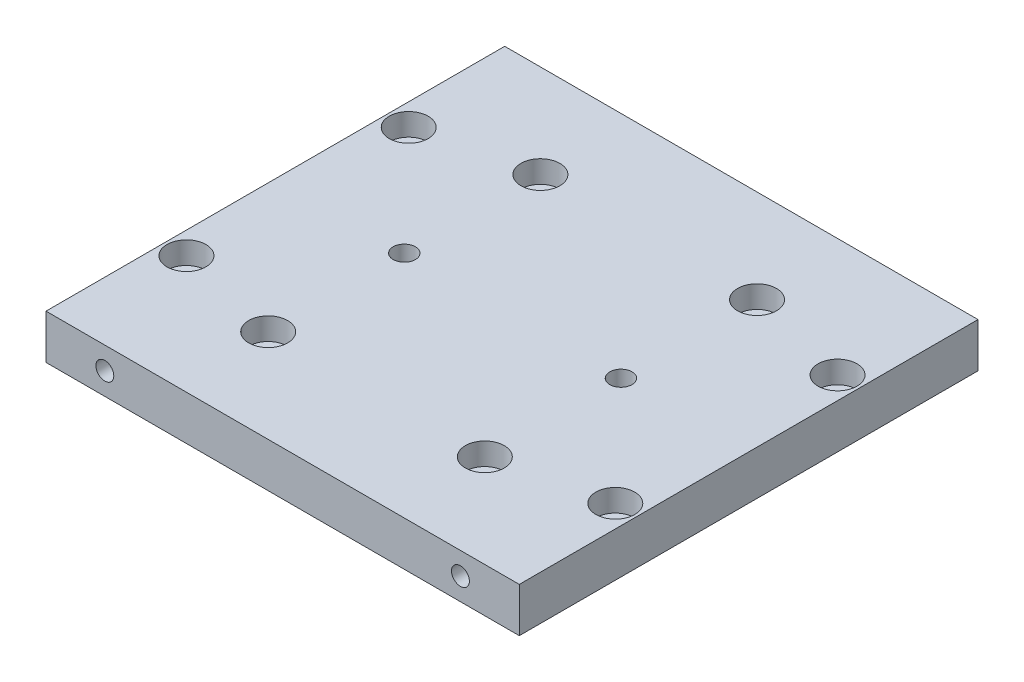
ISO-10303-21;
HEADER;
FILE_DESCRIPTION(('STEP AP214'),'2;1');
FILE_NAME('part.step','',(''),(''),'','','');
FILE_SCHEMA(('AUTOMOTIVE_DESIGN { 1 0 10303 214 1 1 1 1 }'));
ENDSEC;
DATA;
#1=APPLICATION_CONTEXT('core data for automotive mechanical design processes');
#2=APPLICATION_PROTOCOL_DEFINITION('international standard','automotive_design',2000,#1);
#3=PRODUCT_CONTEXT('',#1,'mechanical');
#4=PRODUCT('Part','Part','',(#3));
#5=PRODUCT_RELATED_PRODUCT_CATEGORY('part','',(#4));
#6=PRODUCT_DEFINITION_FORMATION('','',#4);
#7=PRODUCT_DEFINITION_CONTEXT('part definition',#1,'design');
#8=PRODUCT_DEFINITION('design','',#6,#7);
#9=PRODUCT_DEFINITION_SHAPE('','',#8);
#10=(LENGTH_UNIT() NAMED_UNIT(*) SI_UNIT(.MILLI.,.METRE.));
#11=(NAMED_UNIT(*) PLANE_ANGLE_UNIT() SI_UNIT($,.RADIAN.));
#12=(NAMED_UNIT(*) SI_UNIT($,.STERADIAN.) SOLID_ANGLE_UNIT());
#13=UNCERTAINTY_MEASURE_WITH_UNIT(LENGTH_MEASURE(1.E-05),#10,'distance_accuracy_value','');
#14=(GEOMETRIC_REPRESENTATION_CONTEXT(3) GLOBAL_UNCERTAINTY_ASSIGNED_CONTEXT((#13)) GLOBAL_UNIT_ASSIGNED_CONTEXT((#10,
#11,#12)) REPRESENTATION_CONTEXT('',''));
#15=CARTESIAN_POINT('',(0.,0.,0.));
#16=DIRECTION('',(0.,0.,1.));
#17=DIRECTION('',(1.,0.,0.));
#18=AXIS2_PLACEMENT_3D('',#15,#16,#17);
#19=CARTESIAN_POINT('',(67.6148,12.7,-65.532));
#20=DIRECTION('',(-1.,0.,0.));
#21=DIRECTION('',(0.,0.,1.));
#22=AXIS2_PLACEMENT_3D('',#19,#20,#21);
#23=PLANE('',#22);
#24=DIRECTION('',(0.,0.,-1.));
#25=VECTOR('',#24,1.);
#26=CARTESIAN_POINT('',(67.6148,0.,-65.532));
#27=LINE('',#26,#25);
#28=CARTESIAN_POINT('',(67.6148,0.,65.532));
#29=VERTEX_POINT('',#28);
#30=CARTESIAN_POINT('',(67.6148,0.,-65.532));
#31=VERTEX_POINT('',#30);
#32=EDGE_CURVE('E222',#29,#31,#27,.T.);
#33=ORIENTED_EDGE('',*,*,#32,.T.);
#34=DIRECTION('',(0.,-1.,0.));
#35=VECTOR('',#34,1.);
#36=CARTESIAN_POINT('',(67.6148,12.7,-65.532));
#37=LINE('',#36,#35);
#38=CARTESIAN_POINT('',(67.6148,12.7,-65.532));
#39=VERTEX_POINT('',#38);
#40=EDGE_CURVE('E11',#39,#31,#37,.T.);
#41=ORIENTED_EDGE('',*,*,#40,.F.);
#42=DIRECTION('',(0.,0.,-1.));
#43=VECTOR('',#42,1.);
#44=CARTESIAN_POINT('',(67.6148,12.7,-65.532));
#45=LINE('',#44,#43);
#46=CARTESIAN_POINT('',(67.6148,12.7,65.532));
#47=VERTEX_POINT('',#46);
#48=EDGE_CURVE('E223',#47,#39,#45,.T.);
#49=ORIENTED_EDGE('',*,*,#48,.F.);
#50=DIRECTION('',(0.,-1.,0.));
#51=VECTOR('',#50,1.);
#52=CARTESIAN_POINT('',(67.6148,12.7,65.532));
#53=LINE('',#52,#51);
#54=EDGE_CURVE('E229',#47,#29,#53,.T.);
#55=ORIENTED_EDGE('',*,*,#54,.T.);
#56=EDGE_LOOP('',(#33,#41,#49,#55));
#57=FACE_BOUND('',#56,.T.);
#58=ADVANCED_FACE('F39',(#57),#23,.F.);
#59=CARTESIAN_POINT('',(-67.6148,12.7,-65.532));
#60=DIRECTION('',(0.,0.,1.));
#61=DIRECTION('',(1.,0.,0.));
#62=AXIS2_PLACEMENT_3D('',#59,#60,#61);
#63=PLANE('',#62);
#64=DIRECTION('',(-1.,0.,0.));
#65=VECTOR('',#64,1.);
#66=CARTESIAN_POINT('',(-67.6148,0.,-65.532));
#67=LINE('',#66,#65);
#68=CARTESIAN_POINT('',(-67.6148,0.,-65.532));
#69=VERTEX_POINT('',#68);
#70=EDGE_CURVE('E232',#31,#69,#67,.T.);
#71=ORIENTED_EDGE('',*,*,#70,.T.);
#72=DIRECTION('',(0.,-1.,0.));
#73=VECTOR('',#72,1.);
#74=CARTESIAN_POINT('',(-67.6148,12.7,-65.532));
#75=LINE('',#74,#73);
#76=CARTESIAN_POINT('',(-67.6148,12.7,-65.532));
#77=VERTEX_POINT('',#76);
#78=EDGE_CURVE('E47',#77,#69,#75,.T.);
#79=ORIENTED_EDGE('',*,*,#78,.F.);
#80=DIRECTION('',(-1.,0.,0.));
#81=VECTOR('',#80,1.);
#82=CARTESIAN_POINT('',(-67.6148,12.7,-65.532));
#83=LINE('',#82,#81);
#84=EDGE_CURVE('E86',#39,#77,#83,.T.);
#85=ORIENTED_EDGE('',*,*,#84,.F.);
#86=ORIENTED_EDGE('',*,*,#40,.T.);
#87=EDGE_LOOP('',(#71,#79,#85,#86));
#88=FACE_BOUND('',#87,.T.);
#89=ADVANCED_FACE('F257',(#88),#63,.F.);
#90=CARTESIAN_POINT('',(-67.6148,12.7,-65.532));
#91=DIRECTION('',(1.,0.,0.));
#92=DIRECTION('',(0.,0.,-1.));
#93=AXIS2_PLACEMENT_3D('',#90,#91,#92);
#94=PLANE('',#93);
#95=DIRECTION('',(0.,0.,1.));
#96=VECTOR('',#95,1.);
#97=CARTESIAN_POINT('',(-67.6148,0.,-65.532));
#98=LINE('',#97,#96);
#99=CARTESIAN_POINT('',(-67.6148,0.,65.532));
#100=VERTEX_POINT('',#99);
#101=EDGE_CURVE('E73',#69,#100,#98,.T.);
#102=ORIENTED_EDGE('',*,*,#101,.T.);
#103=DIRECTION('',(0.,-1.,0.));
#104=VECTOR('',#103,1.);
#105=CARTESIAN_POINT('',(-67.6148,12.7,65.532));
#106=LINE('',#105,#104);
#107=CARTESIAN_POINT('',(-67.6148,12.7,65.532));
#108=VERTEX_POINT('',#107);
#109=EDGE_CURVE('E237',#108,#100,#106,.T.);
#110=ORIENTED_EDGE('',*,*,#109,.F.);
#111=DIRECTION('',(0.,0.,1.));
#112=VECTOR('',#111,1.);
#113=CARTESIAN_POINT('',(-67.6148,12.7,-65.532));
#114=LINE('',#113,#112);
#115=EDGE_CURVE('E226',#77,#108,#114,.T.);
#116=ORIENTED_EDGE('',*,*,#115,.F.);
#117=ORIENTED_EDGE('',*,*,#78,.T.);
#118=EDGE_LOOP('',(#102,#110,#116,#117));
#119=FACE_BOUND('',#118,.T.);
#120=ADVANCED_FACE('F239',(#119),#94,.F.);
#121=CARTESIAN_POINT('',(-67.6148,12.7,65.532));
#122=DIRECTION('',(0.,0.,-1.));
#123=DIRECTION('',(-1.,0.,0.));
#124=AXIS2_PLACEMENT_3D('',#121,#122,#123);
#125=PLANE('',#124);
#126=CARTESIAN_POINT('',(-50.8,6.35,65.532));
#127=DIRECTION('',(0.,0.,1.));
#128=DIRECTION('',(1.,0.,0.));
#129=AXIS2_PLACEMENT_3D('',#126,#127,#128);
#130=CIRCLE('',#129,2.55269999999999);
#131=CARTESIAN_POINT('',(-48.2473,6.35,65.532));
#132=VERTEX_POINT('',#131);
#133=EDGE_CURVE('E104',#132,#132,#130,.T.);
#134=ORIENTED_EDGE('',*,*,#133,.F.);
#135=EDGE_LOOP('',(#134));
#136=FACE_BOUND('',#135,.T.);
#137=CARTESIAN_POINT('',(50.8,6.35000000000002,65.532));
#138=DIRECTION('',(0.,0.,1.));
#139=DIRECTION('',(1.,0.,0.));
#140=AXIS2_PLACEMENT_3D('',#137,#138,#139);
#141=CIRCLE('',#140,2.55269999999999);
#142=CARTESIAN_POINT('',(53.3527,6.35000000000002,65.532));
#143=VERTEX_POINT('',#142);
#144=EDGE_CURVE('E103',#143,#143,#141,.T.);
#145=ORIENTED_EDGE('',*,*,#144,.F.);
#146=EDGE_LOOP('',(#145));
#147=FACE_BOUND('',#146,.T.);
#148=DIRECTION('',(1.,0.,0.));
#149=VECTOR('',#148,1.);
#150=CARTESIAN_POINT('',(-67.6148,0.,65.532));
#151=LINE('',#150,#149);
#152=EDGE_CURVE('E79',#100,#29,#151,.T.);
#153=ORIENTED_EDGE('',*,*,#152,.T.);
#154=ORIENTED_EDGE('',*,*,#54,.F.);
#155=DIRECTION('',(1.,0.,0.));
#156=VECTOR('',#155,1.);
#157=CARTESIAN_POINT('',(-67.6148,12.7,65.532));
#158=LINE('',#157,#156);
#159=EDGE_CURVE('E55',#108,#47,#158,.T.);
#160=ORIENTED_EDGE('',*,*,#159,.F.);
#161=ORIENTED_EDGE('',*,*,#109,.T.);
#162=EDGE_LOOP('',(#153,#154,#160,#161));
#163=FACE_BOUND('',#162,.T.);
#164=ADVANCED_FACE('F246',(#136,#147,#163),#125,.F.);
#165=CARTESIAN_POINT('',(0.,12.7,0.));
#166=DIRECTION('',(0.,1.,0.));
#167=DIRECTION('',(0.,0.,1.));
#168=AXIS2_PLACEMENT_3D('',#165,#166,#167);
#169=PLANE('',#168);
#170=CARTESIAN_POINT('',(-61.2648,12.7,31.75));
#171=DIRECTION('',(0.,1.,0.));
#172=DIRECTION('',(0.,0.,1.));
#173=AXIS2_PLACEMENT_3D('',#170,#171,#172);
#174=CIRCLE('',#173,5.55625);
#175=CARTESIAN_POINT('',(-61.2648,12.7,37.30625));
#176=VERTEX_POINT('',#175);
#177=EDGE_CURVE('E114',#176,#176,#174,.T.);
#178=ORIENTED_EDGE('',*,*,#177,.F.);
#179=EDGE_LOOP('',(#178));
#180=FACE_BOUND('',#179,.T.);
#181=CARTESIAN_POINT('',(-61.2648,12.7,-31.75));
#182=DIRECTION('',(0.,1.,0.));
#183=DIRECTION('',(0.,0.,1.));
#184=AXIS2_PLACEMENT_3D('',#181,#182,#183);
#185=CIRCLE('',#184,5.55624999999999);
#186=CARTESIAN_POINT('',(-61.2648,12.7,-26.1937500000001));
#187=VERTEX_POINT('',#186);
#188=EDGE_CURVE('E126',#187,#187,#185,.T.);
#189=ORIENTED_EDGE('',*,*,#188,.F.);
#190=EDGE_LOOP('',(#189));
#191=FACE_BOUND('',#190,.T.);
#192=CARTESIAN_POINT('',(61.2648,12.7,31.7500000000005));
#193=DIRECTION('',(0.,1.,0.));
#194=DIRECTION('',(0.,0.,1.));
#195=AXIS2_PLACEMENT_3D('',#192,#193,#194);
#196=CIRCLE('',#195,5.55624999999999);
#197=CARTESIAN_POINT('',(61.2648,12.7,37.3062500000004));
#198=VERTEX_POINT('',#197);
#199=EDGE_CURVE('E138',#198,#198,#196,.T.);
#200=ORIENTED_EDGE('',*,*,#199,.F.);
#201=EDGE_LOOP('',(#200));
#202=FACE_BOUND('',#201,.T.);
#203=CARTESIAN_POINT('',(61.2648000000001,12.7,-31.7499999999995));
#204=DIRECTION('',(0.,1.,0.));
#205=DIRECTION('',(0.,0.,1.));
#206=AXIS2_PLACEMENT_3D('',#203,#204,#205);
#207=CIRCLE('',#206,5.55625);
#208=CARTESIAN_POINT('',(61.2648000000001,12.7,-26.1937499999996));
#209=VERTEX_POINT('',#208);
#210=EDGE_CURVE('E150',#209,#209,#207,.T.);
#211=ORIENTED_EDGE('',*,*,#210,.F.);
#212=EDGE_LOOP('',(#211));
#213=FACE_BOUND('',#212,.T.);
#214=CARTESIAN_POINT('',(-30.7768574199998,12.7,4.95300012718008E-06));
#215=DIRECTION('',(0.,1.,0.));
#216=DIRECTION('',(0.,0.,1.));
#217=AXIS2_PLACEMENT_3D('',#214,#215,#216);
#218=CIRCLE('',#217,3.175);
#219=CARTESIAN_POINT('',(-30.7768574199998,12.7,3.17500495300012));
#220=VERTEX_POINT('',#219);
#221=EDGE_CURVE('E162',#220,#220,#218,.T.);
#222=ORIENTED_EDGE('',*,*,#221,.F.);
#223=EDGE_LOOP('',(#222));
#224=FACE_BOUND('',#223,.T.);
#225=CARTESIAN_POINT('',(31.1229425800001,12.7,4.9530001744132E-06));
#226=DIRECTION('',(0.,1.,0.));
#227=DIRECTION('',(0.,0.,1.));
#228=AXIS2_PLACEMENT_3D('',#225,#226,#227);
#229=CIRCLE('',#228,3.175);
#230=CARTESIAN_POINT('',(31.1229425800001,12.7,3.17500495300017));
#231=VERTEX_POINT('',#230);
#232=EDGE_CURVE('E168',#231,#231,#229,.T.);
#233=ORIENTED_EDGE('',*,*,#232,.F.);
#234=EDGE_LOOP('',(#233));
#235=FACE_BOUND('',#234,.T.);
#236=CARTESIAN_POINT('',(31.1229425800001,12.7,38.8874049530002));
#237=DIRECTION('',(0.,1.,0.));
#238=DIRECTION('',(0.,0.,1.));
#239=AXIS2_PLACEMENT_3D('',#236,#237,#238);
#240=CIRCLE('',#239,5.55625);
#241=CARTESIAN_POINT('',(31.1229425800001,12.7,44.4436549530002));
#242=VERTEX_POINT('',#241);
#243=EDGE_CURVE('E174',#242,#242,#240,.T.);
#244=ORIENTED_EDGE('',*,*,#243,.F.);
#245=EDGE_LOOP('',(#244));
#246=FACE_BOUND('',#245,.T.);
#247=CARTESIAN_POINT('',(-30.7768574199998,12.7,38.8874049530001));
#248=DIRECTION('',(0.,1.,0.));
#249=DIRECTION('',(0.,0.,1.));
#250=AXIS2_PLACEMENT_3D('',#247,#248,#249);
#251=CIRCLE('',#250,5.55625);
#252=CARTESIAN_POINT('',(-30.7768574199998,12.7,44.4436549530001));
#253=VERTEX_POINT('',#252);
#254=EDGE_CURVE('E186',#253,#253,#251,.T.);
#255=ORIENTED_EDGE('',*,*,#254,.F.);
#256=EDGE_LOOP('',(#255));
#257=FACE_BOUND('',#256,.T.);
#258=CARTESIAN_POINT('',(-30.7768574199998,12.7,-38.8873950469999));
#259=DIRECTION('',(0.,1.,0.));
#260=DIRECTION('',(0.,0.,1.));
#261=AXIS2_PLACEMENT_3D('',#258,#259,#260);
#262=CIRCLE('',#261,5.55625);
#263=CARTESIAN_POINT('',(-30.7768574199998,12.7,-33.3311450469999));
#264=VERTEX_POINT('',#263);
#265=EDGE_CURVE('E198',#264,#264,#262,.T.);
#266=ORIENTED_EDGE('',*,*,#265,.F.);
#267=EDGE_LOOP('',(#266));
#268=FACE_BOUND('',#267,.T.);
#269=CARTESIAN_POINT('',(31.1229425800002,12.7,-38.8873950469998));
#270=DIRECTION('',(0.,1.,0.));
#271=DIRECTION('',(0.,0.,1.));
#272=AXIS2_PLACEMENT_3D('',#269,#270,#271);
#273=CIRCLE('',#272,5.55625);
#274=CARTESIAN_POINT('',(31.1229425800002,12.7,-33.3311450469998));
#275=VERTEX_POINT('',#274);
#276=EDGE_CURVE('E210',#275,#275,#273,.T.);
#277=ORIENTED_EDGE('',*,*,#276,.F.);
#278=EDGE_LOOP('',(#277));
#279=FACE_BOUND('',#278,.T.);
#280=ORIENTED_EDGE('',*,*,#48,.T.);
#281=ORIENTED_EDGE('',*,*,#84,.T.);
#282=ORIENTED_EDGE('',*,*,#115,.T.);
#283=ORIENTED_EDGE('',*,*,#159,.T.);
#284=EDGE_LOOP('',(#280,#281,#282,#283));
#285=FACE_BOUND('',#284,.T.);
#286=ADVANCED_FACE('F248',(#180,#191,#202,#213,#224,#235,#246,#257,#268,#279,#285),#169,.T.);
#287=CARTESIAN_POINT('',(0.,0.,0.));
#288=DIRECTION('',(0.,1.,0.));
#289=DIRECTION('',(0.,0.,1.));
#290=AXIS2_PLACEMENT_3D('',#287,#288,#289);
#291=PLANE('',#290);
#292=CARTESIAN_POINT('',(-61.2648,0.,31.75));
#293=DIRECTION('',(0.,1.,0.));
#294=DIRECTION('',(0.,0.,1.));
#295=AXIS2_PLACEMENT_3D('',#292,#293,#294);
#296=CIRCLE('',#295,3.3782);
#297=CARTESIAN_POINT('',(-61.2648,0.,35.1282));
#298=VERTEX_POINT('',#297);
#299=EDGE_CURVE('E123',#298,#298,#296,.T.);
#300=ORIENTED_EDGE('',*,*,#299,.T.);
#301=EDGE_LOOP('',(#300));
#302=FACE_BOUND('',#301,.T.);
#303=CARTESIAN_POINT('',(-61.2648,0.,-31.75));
#304=DIRECTION('',(0.,1.,0.));
#305=DIRECTION('',(0.,0.,1.));
#306=AXIS2_PLACEMENT_3D('',#303,#304,#305);
#307=CIRCLE('',#306,3.3782);
#308=CARTESIAN_POINT('',(-61.2648,0.,-28.3718));
#309=VERTEX_POINT('',#308);
#310=EDGE_CURVE('E135',#309,#309,#307,.T.);
#311=ORIENTED_EDGE('',*,*,#310,.T.);
#312=EDGE_LOOP('',(#311));
#313=FACE_BOUND('',#312,.T.);
#314=CARTESIAN_POINT('',(61.2648,0.,31.7500000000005));
#315=DIRECTION('',(0.,1.,0.));
#316=DIRECTION('',(0.,0.,1.));
#317=AXIS2_PLACEMENT_3D('',#314,#315,#316);
#318=CIRCLE('',#317,3.37819999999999);
#319=CARTESIAN_POINT('',(61.2648,0.,35.1282000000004));
#320=VERTEX_POINT('',#319);
#321=EDGE_CURVE('E147',#320,#320,#318,.T.);
#322=ORIENTED_EDGE('',*,*,#321,.T.);
#323=EDGE_LOOP('',(#322));
#324=FACE_BOUND('',#323,.T.);
#325=CARTESIAN_POINT('',(61.2648000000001,0.,-31.7499999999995));
#326=DIRECTION('',(0.,1.,0.));
#327=DIRECTION('',(0.,0.,1.));
#328=AXIS2_PLACEMENT_3D('',#325,#326,#327);
#329=CIRCLE('',#328,3.3782);
#330=CARTESIAN_POINT('',(61.2648000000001,0.,-28.3717999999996));
#331=VERTEX_POINT('',#330);
#332=EDGE_CURVE('E159',#331,#331,#329,.T.);
#333=ORIENTED_EDGE('',*,*,#332,.T.);
#334=EDGE_LOOP('',(#333));
#335=FACE_BOUND('',#334,.T.);
#336=CARTESIAN_POINT('',(-30.7768574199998,0.,4.95300012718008E-06));
#337=DIRECTION('',(0.,1.,0.));
#338=DIRECTION('',(0.,0.,1.));
#339=AXIS2_PLACEMENT_3D('',#336,#337,#338);
#340=CIRCLE('',#339,3.175);
#341=CARTESIAN_POINT('',(-30.7768574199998,0.,3.17500495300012));
#342=VERTEX_POINT('',#341);
#343=EDGE_CURVE('E165',#342,#342,#340,.T.);
#344=ORIENTED_EDGE('',*,*,#343,.T.);
#345=EDGE_LOOP('',(#344));
#346=FACE_BOUND('',#345,.T.);
#347=CARTESIAN_POINT('',(31.1229425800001,0.,4.9530001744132E-06));
#348=DIRECTION('',(0.,1.,0.));
#349=DIRECTION('',(0.,0.,1.));
#350=AXIS2_PLACEMENT_3D('',#347,#348,#349);
#351=CIRCLE('',#350,3.175);
#352=CARTESIAN_POINT('',(31.1229425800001,0.,3.17500495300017));
#353=VERTEX_POINT('',#352);
#354=EDGE_CURVE('E171',#353,#353,#351,.T.);
#355=ORIENTED_EDGE('',*,*,#354,.T.);
#356=EDGE_LOOP('',(#355));
#357=FACE_BOUND('',#356,.T.);
#358=CARTESIAN_POINT('',(31.1229425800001,0.,38.8874049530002));
#359=DIRECTION('',(0.,1.,0.));
#360=DIRECTION('',(0.,0.,1.));
#361=AXIS2_PLACEMENT_3D('',#358,#359,#360);
#362=CIRCLE('',#361,3.37819999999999);
#363=CARTESIAN_POINT('',(31.1229425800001,0.,42.2656049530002));
#364=VERTEX_POINT('',#363);
#365=EDGE_CURVE('E183',#364,#364,#362,.T.);
#366=ORIENTED_EDGE('',*,*,#365,.T.);
#367=EDGE_LOOP('',(#366));
#368=FACE_BOUND('',#367,.T.);
#369=CARTESIAN_POINT('',(-30.7768574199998,0.,38.8874049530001));
#370=DIRECTION('',(0.,1.,0.));
#371=DIRECTION('',(0.,0.,1.));
#372=AXIS2_PLACEMENT_3D('',#369,#370,#371);
#373=CIRCLE('',#372,3.3782);
#374=CARTESIAN_POINT('',(-30.7768574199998,0.,42.2656049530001));
#375=VERTEX_POINT('',#374);
#376=EDGE_CURVE('E195',#375,#375,#373,.T.);
#377=ORIENTED_EDGE('',*,*,#376,.T.);
#378=EDGE_LOOP('',(#377));
#379=FACE_BOUND('',#378,.T.);
#380=CARTESIAN_POINT('',(-30.7768574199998,0.,-38.8873950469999));
#381=DIRECTION('',(0.,1.,0.));
#382=DIRECTION('',(0.,0.,1.));
#383=AXIS2_PLACEMENT_3D('',#380,#381,#382);
#384=CIRCLE('',#383,3.3782);
#385=CARTESIAN_POINT('',(-30.7768574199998,0.,-35.5091950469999));
#386=VERTEX_POINT('',#385);
#387=EDGE_CURVE('E207',#386,#386,#384,.T.);
#388=ORIENTED_EDGE('',*,*,#387,.T.);
#389=EDGE_LOOP('',(#388));
#390=FACE_BOUND('',#389,.T.);
#391=CARTESIAN_POINT('',(31.1229425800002,0.,-38.8873950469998));
#392=DIRECTION('',(0.,1.,0.));
#393=DIRECTION('',(0.,0.,1.));
#394=AXIS2_PLACEMENT_3D('',#391,#392,#393);
#395=CIRCLE('',#394,3.37819999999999);
#396=CARTESIAN_POINT('',(31.1229425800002,0.,-35.5091950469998));
#397=VERTEX_POINT('',#396);
#398=EDGE_CURVE('E219',#397,#397,#395,.T.);
#399=ORIENTED_EDGE('',*,*,#398,.T.);
#400=EDGE_LOOP('',(#399));
#401=FACE_BOUND('',#400,.T.);
#402=ORIENTED_EDGE('',*,*,#32,.F.);
#403=ORIENTED_EDGE('',*,*,#152,.F.);
#404=ORIENTED_EDGE('',*,*,#101,.F.);
#405=ORIENTED_EDGE('',*,*,#70,.F.);
#406=EDGE_LOOP('',(#402,#403,#404,#405));
#407=FACE_BOUND('',#406,.T.);
#408=ADVANCED_FACE('F242',(#302,#313,#324,#335,#346,#357,#368,#379,#390,#401,#407),#291,.F.);
#409=CARTESIAN_POINT('',(31.1229425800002,12.7,-38.8873950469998));
#410=DIRECTION('',(0.,1.,0.));
#411=DIRECTION('',(0.,0.,1.));
#412=AXIS2_PLACEMENT_3D('',#409,#410,#411);
#413=CYLINDRICAL_SURFACE('',#412,3.3782);
#414=ORIENTED_EDGE('',*,*,#398,.F.);
#415=EDGE_LOOP('',(#414));
#416=FACE_BOUND('',#415,.T.);
#417=CARTESIAN_POINT('',(31.1229425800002,6.35,-38.8873950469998));
#418=DIRECTION('',(0.,1.,0.));
#419=DIRECTION('',(0.,0.,1.));
#420=AXIS2_PLACEMENT_3D('',#417,#418,#419);
#421=CIRCLE('',#420,3.3782);
#422=CARTESIAN_POINT('',(31.1229425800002,6.35,-35.5091950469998));
#423=VERTEX_POINT('',#422);
#424=EDGE_CURVE('E216',#423,#423,#421,.T.);
#425=ORIENTED_EDGE('',*,*,#424,.T.);
#426=EDGE_LOOP('',(#425));
#427=FACE_BOUND('',#426,.T.);
#428=ADVANCED_FACE('F278',(#416,#427),#413,.F.);
#429=CARTESIAN_POINT('',(34.5011425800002,6.35,-38.8873950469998));
#430=DIRECTION('',(0.,-1.,0.));
#431=DIRECTION('',(0.,0.,-1.));
#432=AXIS2_PLACEMENT_3D('',#429,#430,#431);
#433=PLANE('',#432);
#434=ORIENTED_EDGE('',*,*,#424,.F.);
#435=EDGE_LOOP('',(#434));
#436=FACE_BOUND('',#435,.T.);
#437=CARTESIAN_POINT('',(31.1229425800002,6.35,-38.8873950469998));
#438=DIRECTION('',(0.,1.,0.));
#439=DIRECTION('',(0.,0.,1.));
#440=AXIS2_PLACEMENT_3D('',#437,#438,#439);
#441=CIRCLE('',#440,5.55625);
#442=CARTESIAN_POINT('',(31.1229425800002,6.35,-33.3311450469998));
#443=VERTEX_POINT('',#442);
#444=EDGE_CURVE('E213',#443,#443,#441,.T.);
#445=ORIENTED_EDGE('',*,*,#444,.T.);
#446=EDGE_LOOP('',(#445));
#447=FACE_BOUND('',#446,.T.);
#448=ADVANCED_FACE('F283',(#436,#447),#433,.F.);
#449=CARTESIAN_POINT('',(31.1229425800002,12.7,-38.8873950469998));
#450=DIRECTION('',(0.,1.,0.));
#451=DIRECTION('',(0.,0.,1.));
#452=AXIS2_PLACEMENT_3D('',#449,#450,#451);
#453=CYLINDRICAL_SURFACE('',#452,5.55625);
#454=ORIENTED_EDGE('',*,*,#444,.F.);
#455=EDGE_LOOP('',(#454));
#456=FACE_BOUND('',#455,.T.);
#457=ORIENTED_EDGE('',*,*,#276,.T.);
#458=EDGE_LOOP('',(#457));
#459=FACE_BOUND('',#458,.T.);
#460=ADVANCED_FACE('F295',(#456,#459),#453,.F.);
#461=CARTESIAN_POINT('',(-30.7768574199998,12.7,-38.8873950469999));
#462=DIRECTION('',(0.,1.,0.));
#463=DIRECTION('',(0.,0.,1.));
#464=AXIS2_PLACEMENT_3D('',#461,#462,#463);
#465=CYLINDRICAL_SURFACE('',#464,3.3782);
#466=ORIENTED_EDGE('',*,*,#387,.F.);
#467=EDGE_LOOP('',(#466));
#468=FACE_BOUND('',#467,.T.);
#469=CARTESIAN_POINT('',(-30.7768574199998,6.35,-38.8873950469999));
#470=DIRECTION('',(0.,1.,0.));
#471=DIRECTION('',(0.,0.,1.));
#472=AXIS2_PLACEMENT_3D('',#469,#470,#471);
#473=CIRCLE('',#472,3.3782);
#474=CARTESIAN_POINT('',(-30.7768574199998,6.35,-35.5091950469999));
#475=VERTEX_POINT('',#474);
#476=EDGE_CURVE('E204',#475,#475,#473,.T.);
#477=ORIENTED_EDGE('',*,*,#476,.T.);
#478=EDGE_LOOP('',(#477));
#479=FACE_BOUND('',#478,.T.);
#480=ADVANCED_FACE('F305',(#468,#479),#465,.F.);
#481=CARTESIAN_POINT('',(-27.3986574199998,6.35,-38.8873950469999));
#482=DIRECTION('',(0.,-1.,0.));
#483=DIRECTION('',(0.,0.,-1.));
#484=AXIS2_PLACEMENT_3D('',#481,#482,#483);
#485=PLANE('',#484);
#486=ORIENTED_EDGE('',*,*,#476,.F.);
#487=EDGE_LOOP('',(#486));
#488=FACE_BOUND('',#487,.T.);
#489=CARTESIAN_POINT('',(-30.7768574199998,6.35,-38.8873950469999));
#490=DIRECTION('',(0.,1.,0.));
#491=DIRECTION('',(0.,0.,1.));
#492=AXIS2_PLACEMENT_3D('',#489,#490,#491);
#493=CIRCLE('',#492,5.55625);
#494=CARTESIAN_POINT('',(-30.7768574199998,6.35,-33.3311450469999));
#495=VERTEX_POINT('',#494);
#496=EDGE_CURVE('E201',#495,#495,#493,.T.);
#497=ORIENTED_EDGE('',*,*,#496,.T.);
#498=EDGE_LOOP('',(#497));
#499=FACE_BOUND('',#498,.T.);
#500=ADVANCED_FACE('F315',(#488,#499),#485,.F.);
#501=CARTESIAN_POINT('',(-30.7768574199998,12.7,-38.8873950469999));
#502=DIRECTION('',(0.,1.,0.));
#503=DIRECTION('',(0.,0.,1.));
#504=AXIS2_PLACEMENT_3D('',#501,#502,#503);
#505=CYLINDRICAL_SURFACE('',#504,5.55625);
#506=ORIENTED_EDGE('',*,*,#496,.F.);
#507=EDGE_LOOP('',(#506));
#508=FACE_BOUND('',#507,.T.);
#509=ORIENTED_EDGE('',*,*,#265,.T.);
#510=EDGE_LOOP('',(#509));
#511=FACE_BOUND('',#510,.T.);
#512=ADVANCED_FACE('F325',(#508,#511),#505,.F.);
#513=CARTESIAN_POINT('',(-30.7768574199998,12.7,38.8874049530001));
#514=DIRECTION('',(0.,1.,0.));
#515=DIRECTION('',(0.,0.,1.));
#516=AXIS2_PLACEMENT_3D('',#513,#514,#515);
#517=CYLINDRICAL_SURFACE('',#516,3.3782);
#518=ORIENTED_EDGE('',*,*,#376,.F.);
#519=EDGE_LOOP('',(#518));
#520=FACE_BOUND('',#519,.T.);
#521=CARTESIAN_POINT('',(-30.7768574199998,6.35,38.8874049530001));
#522=DIRECTION('',(0.,1.,0.));
#523=DIRECTION('',(0.,0.,1.));
#524=AXIS2_PLACEMENT_3D('',#521,#522,#523);
#525=CIRCLE('',#524,3.3782);
#526=CARTESIAN_POINT('',(-30.7768574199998,6.35,42.2656049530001));
#527=VERTEX_POINT('',#526);
#528=EDGE_CURVE('E192',#527,#527,#525,.T.);
#529=ORIENTED_EDGE('',*,*,#528,.T.);
#530=EDGE_LOOP('',(#529));
#531=FACE_BOUND('',#530,.T.);
#532=ADVANCED_FACE('F335',(#520,#531),#517,.F.);
#533=CARTESIAN_POINT('',(-27.3986574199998,6.35,38.8874049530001));
#534=DIRECTION('',(0.,-1.,0.));
#535=DIRECTION('',(0.,0.,-1.));
#536=AXIS2_PLACEMENT_3D('',#533,#534,#535);
#537=PLANE('',#536);
#538=ORIENTED_EDGE('',*,*,#528,.F.);
#539=EDGE_LOOP('',(#538));
#540=FACE_BOUND('',#539,.T.);
#541=CARTESIAN_POINT('',(-30.7768574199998,6.35,38.8874049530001));
#542=DIRECTION('',(0.,1.,0.));
#543=DIRECTION('',(0.,0.,1.));
#544=AXIS2_PLACEMENT_3D('',#541,#542,#543);
#545=CIRCLE('',#544,5.55625);
#546=CARTESIAN_POINT('',(-30.7768574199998,6.35,44.4436549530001));
#547=VERTEX_POINT('',#546);
#548=EDGE_CURVE('E189',#547,#547,#545,.T.);
#549=ORIENTED_EDGE('',*,*,#548,.T.);
#550=EDGE_LOOP('',(#549));
#551=FACE_BOUND('',#550,.T.);
#552=ADVANCED_FACE('F345',(#540,#551),#537,.F.);
#553=CARTESIAN_POINT('',(-30.7768574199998,12.7,38.8874049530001));
#554=DIRECTION('',(0.,1.,0.));
#555=DIRECTION('',(0.,0.,1.));
#556=AXIS2_PLACEMENT_3D('',#553,#554,#555);
#557=CYLINDRICAL_SURFACE('',#556,5.55625);
#558=ORIENTED_EDGE('',*,*,#548,.F.);
#559=EDGE_LOOP('',(#558));
#560=FACE_BOUND('',#559,.T.);
#561=ORIENTED_EDGE('',*,*,#254,.T.);
#562=EDGE_LOOP('',(#561));
#563=FACE_BOUND('',#562,.T.);
#564=ADVANCED_FACE('F355',(#560,#563),#557,.F.);
#565=CARTESIAN_POINT('',(31.1229425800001,12.7,38.8874049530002));
#566=DIRECTION('',(0.,1.,0.));
#567=DIRECTION('',(0.,0.,1.));
#568=AXIS2_PLACEMENT_3D('',#565,#566,#567);
#569=CYLINDRICAL_SURFACE('',#568,3.3782);
#570=ORIENTED_EDGE('',*,*,#365,.F.);
#571=EDGE_LOOP('',(#570));
#572=FACE_BOUND('',#571,.T.);
#573=CARTESIAN_POINT('',(31.1229425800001,6.35,38.8874049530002));
#574=DIRECTION('',(0.,1.,0.));
#575=DIRECTION('',(0.,0.,1.));
#576=AXIS2_PLACEMENT_3D('',#573,#574,#575);
#577=CIRCLE('',#576,3.3782);
#578=CARTESIAN_POINT('',(31.1229425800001,6.35,42.2656049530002));
#579=VERTEX_POINT('',#578);
#580=EDGE_CURVE('E180',#579,#579,#577,.T.);
#581=ORIENTED_EDGE('',*,*,#580,.T.);
#582=EDGE_LOOP('',(#581));
#583=FACE_BOUND('',#582,.T.);
#584=ADVANCED_FACE('F365',(#572,#583),#569,.F.);
#585=CARTESIAN_POINT('',(34.5011425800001,6.35,38.8874049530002));
#586=DIRECTION('',(0.,-1.,0.));
#587=DIRECTION('',(0.,0.,-1.));
#588=AXIS2_PLACEMENT_3D('',#585,#586,#587);
#589=PLANE('',#588);
#590=ORIENTED_EDGE('',*,*,#580,.F.);
#591=EDGE_LOOP('',(#590));
#592=FACE_BOUND('',#591,.T.);
#593=CARTESIAN_POINT('',(31.1229425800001,6.35,38.8874049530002));
#594=DIRECTION('',(0.,1.,0.));
#595=DIRECTION('',(0.,0.,1.));
#596=AXIS2_PLACEMENT_3D('',#593,#594,#595);
#597=CIRCLE('',#596,5.55625);
#598=CARTESIAN_POINT('',(31.1229425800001,6.35,44.4436549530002));
#599=VERTEX_POINT('',#598);
#600=EDGE_CURVE('E177',#599,#599,#597,.T.);
#601=ORIENTED_EDGE('',*,*,#600,.T.);
#602=EDGE_LOOP('',(#601));
#603=FACE_BOUND('',#602,.T.);
#604=ADVANCED_FACE('F375',(#592,#603),#589,.F.);
#605=CARTESIAN_POINT('',(31.1229425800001,12.7,38.8874049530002));
#606=DIRECTION('',(0.,1.,0.));
#607=DIRECTION('',(0.,0.,1.));
#608=AXIS2_PLACEMENT_3D('',#605,#606,#607);
#609=CYLINDRICAL_SURFACE('',#608,5.55625);
#610=ORIENTED_EDGE('',*,*,#600,.F.);
#611=EDGE_LOOP('',(#610));
#612=FACE_BOUND('',#611,.T.);
#613=ORIENTED_EDGE('',*,*,#243,.T.);
#614=EDGE_LOOP('',(#613));
#615=FACE_BOUND('',#614,.T.);
#616=ADVANCED_FACE('F385',(#612,#615),#609,.F.);
#617=CARTESIAN_POINT('',(31.1229425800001,12.7,4.9530001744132E-06));
#618=DIRECTION('',(0.,1.,0.));
#619=DIRECTION('',(0.,0.,1.));
#620=AXIS2_PLACEMENT_3D('',#617,#618,#619);
#621=CYLINDRICAL_SURFACE('',#620,3.175);
#622=ORIENTED_EDGE('',*,*,#354,.F.);
#623=EDGE_LOOP('',(#622));
#624=FACE_BOUND('',#623,.T.);
#625=ORIENTED_EDGE('',*,*,#232,.T.);
#626=EDGE_LOOP('',(#625));
#627=FACE_BOUND('',#626,.T.);
#628=ADVANCED_FACE('F395',(#624,#627),#621,.F.);
#629=CARTESIAN_POINT('',(-30.7768574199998,12.7,4.95300012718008E-06));
#630=DIRECTION('',(0.,1.,0.));
#631=DIRECTION('',(0.,0.,1.));
#632=AXIS2_PLACEMENT_3D('',#629,#630,#631);
#633=CYLINDRICAL_SURFACE('',#632,3.175);
#634=ORIENTED_EDGE('',*,*,#343,.F.);
#635=EDGE_LOOP('',(#634));
#636=FACE_BOUND('',#635,.T.);
#637=ORIENTED_EDGE('',*,*,#221,.T.);
#638=EDGE_LOOP('',(#637));
#639=FACE_BOUND('',#638,.T.);
#640=ADVANCED_FACE('F405',(#636,#639),#633,.F.);
#641=CARTESIAN_POINT('',(61.2648000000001,12.7,-31.7499999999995));
#642=DIRECTION('',(0.,1.,0.));
#643=DIRECTION('',(0.,0.,1.));
#644=AXIS2_PLACEMENT_3D('',#641,#642,#643);
#645=CYLINDRICAL_SURFACE('',#644,3.3782);
#646=ORIENTED_EDGE('',*,*,#332,.F.);
#647=EDGE_LOOP('',(#646));
#648=FACE_BOUND('',#647,.T.);
#649=CARTESIAN_POINT('',(61.2648000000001,6.35,-31.7499999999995));
#650=DIRECTION('',(0.,1.,0.));
#651=DIRECTION('',(0.,0.,1.));
#652=AXIS2_PLACEMENT_3D('',#649,#650,#651);
#653=CIRCLE('',#652,3.37820000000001);
#654=CARTESIAN_POINT('',(61.2648000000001,6.35,-28.3717999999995));
#655=VERTEX_POINT('',#654);
#656=EDGE_CURVE('E156',#655,#655,#653,.T.);
#657=ORIENTED_EDGE('',*,*,#656,.T.);
#658=EDGE_LOOP('',(#657));
#659=FACE_BOUND('',#658,.T.);
#660=ADVANCED_FACE('F415',(#648,#659),#645,.F.);
#661=CARTESIAN_POINT('',(64.6430000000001,6.35,-31.7499999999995));
#662=DIRECTION('',(0.,-1.,0.));
#663=DIRECTION('',(0.,0.,-1.));
#664=AXIS2_PLACEMENT_3D('',#661,#662,#663);
#665=PLANE('',#664);
#666=ORIENTED_EDGE('',*,*,#656,.F.);
#667=EDGE_LOOP('',(#666));
#668=FACE_BOUND('',#667,.T.);
#669=CARTESIAN_POINT('',(61.2648000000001,6.35,-31.7499999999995));
#670=DIRECTION('',(0.,1.,0.));
#671=DIRECTION('',(0.,0.,1.));
#672=AXIS2_PLACEMENT_3D('',#669,#670,#671);
#673=CIRCLE('',#672,5.55625);
#674=CARTESIAN_POINT('',(61.2648000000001,6.35,-26.1937499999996));
#675=VERTEX_POINT('',#674);
#676=EDGE_CURVE('E153',#675,#675,#673,.T.);
#677=ORIENTED_EDGE('',*,*,#676,.T.);
#678=EDGE_LOOP('',(#677));
#679=FACE_BOUND('',#678,.T.);
#680=ADVANCED_FACE('F437',(#668,#679),#665,.F.);
#681=CARTESIAN_POINT('',(61.2648000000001,12.7,-31.7499999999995));
#682=DIRECTION('',(0.,1.,0.));
#683=DIRECTION('',(0.,0.,1.));
#684=AXIS2_PLACEMENT_3D('',#681,#682,#683);
#685=CYLINDRICAL_SURFACE('',#684,5.55625);
#686=ORIENTED_EDGE('',*,*,#676,.F.);
#687=EDGE_LOOP('',(#686));
#688=FACE_BOUND('',#687,.T.);
#689=ORIENTED_EDGE('',*,*,#210,.T.);
#690=EDGE_LOOP('',(#689));
#691=FACE_BOUND('',#690,.T.);
#692=ADVANCED_FACE('F447',(#688,#691),#685,.F.);
#693=CARTESIAN_POINT('',(61.2648,12.7,31.7500000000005));
#694=DIRECTION('',(0.,1.,0.));
#695=DIRECTION('',(0.,0.,1.));
#696=AXIS2_PLACEMENT_3D('',#693,#694,#695);
#697=CYLINDRICAL_SURFACE('',#696,3.3782);
#698=ORIENTED_EDGE('',*,*,#321,.F.);
#699=EDGE_LOOP('',(#698));
#700=FACE_BOUND('',#699,.T.);
#701=CARTESIAN_POINT('',(61.2648,6.35,31.7500000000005));
#702=DIRECTION('',(0.,1.,0.));
#703=DIRECTION('',(0.,0.,1.));
#704=AXIS2_PLACEMENT_3D('',#701,#702,#703);
#705=CIRCLE('',#704,3.3782);
#706=CARTESIAN_POINT('',(61.2648,6.35,35.1282000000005));
#707=VERTEX_POINT('',#706);
#708=EDGE_CURVE('E144',#707,#707,#705,.T.);
#709=ORIENTED_EDGE('',*,*,#708,.T.);
#710=EDGE_LOOP('',(#709));
#711=FACE_BOUND('',#710,.T.);
#712=ADVANCED_FACE('F457',(#700,#711),#697,.F.);
#713=CARTESIAN_POINT('',(64.643,6.35,31.7500000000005));
#714=DIRECTION('',(0.,-1.,0.));
#715=DIRECTION('',(0.,0.,-1.));
#716=AXIS2_PLACEMENT_3D('',#713,#714,#715);
#717=PLANE('',#716);
#718=ORIENTED_EDGE('',*,*,#708,.F.);
#719=EDGE_LOOP('',(#718));
#720=FACE_BOUND('',#719,.T.);
#721=CARTESIAN_POINT('',(61.2648,6.35,31.7500000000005));
#722=DIRECTION('',(0.,1.,0.));
#723=DIRECTION('',(0.,0.,1.));
#724=AXIS2_PLACEMENT_3D('',#721,#722,#723);
#725=CIRCLE('',#724,5.55624999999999);
#726=CARTESIAN_POINT('',(61.2648,6.35,37.3062500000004));
#727=VERTEX_POINT('',#726);
#728=EDGE_CURVE('E141',#727,#727,#725,.T.);
#729=ORIENTED_EDGE('',*,*,#728,.T.);
#730=EDGE_LOOP('',(#729));
#731=FACE_BOUND('',#730,.T.);
#732=ADVANCED_FACE('F467',(#720,#731),#717,.F.);
#733=CARTESIAN_POINT('',(61.2648,12.7,31.7500000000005));
#734=DIRECTION('',(0.,1.,0.));
#735=DIRECTION('',(0.,0.,1.));
#736=AXIS2_PLACEMENT_3D('',#733,#734,#735);
#737=CYLINDRICAL_SURFACE('',#736,5.55624999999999);
#738=ORIENTED_EDGE('',*,*,#728,.F.);
#739=EDGE_LOOP('',(#738));
#740=FACE_BOUND('',#739,.T.);
#741=ORIENTED_EDGE('',*,*,#199,.T.);
#742=EDGE_LOOP('',(#741));
#743=FACE_BOUND('',#742,.T.);
#744=ADVANCED_FACE('F477',(#740,#743),#737,.F.);
#745=CARTESIAN_POINT('',(-61.2648,12.7,-31.75));
#746=DIRECTION('',(0.,1.,0.));
#747=DIRECTION('',(0.,0.,1.));
#748=AXIS2_PLACEMENT_3D('',#745,#746,#747);
#749=CYLINDRICAL_SURFACE('',#748,3.3782);
#750=ORIENTED_EDGE('',*,*,#310,.F.);
#751=EDGE_LOOP('',(#750));
#752=FACE_BOUND('',#751,.T.);
#753=CARTESIAN_POINT('',(-61.2648,6.35,-31.75));
#754=DIRECTION('',(0.,1.,0.));
#755=DIRECTION('',(0.,0.,1.));
#756=AXIS2_PLACEMENT_3D('',#753,#754,#755);
#757=CIRCLE('',#756,3.37820000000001);
#758=CARTESIAN_POINT('',(-61.2648,6.35,-28.3718));
#759=VERTEX_POINT('',#758);
#760=EDGE_CURVE('E132',#759,#759,#757,.T.);
#761=ORIENTED_EDGE('',*,*,#760,.T.);
#762=EDGE_LOOP('',(#761));
#763=FACE_BOUND('',#762,.T.);
#764=ADVANCED_FACE('F487',(#752,#763),#749,.F.);
#765=CARTESIAN_POINT('',(-57.8865999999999,6.35,-31.75));
#766=DIRECTION('',(0.,-1.,0.));
#767=DIRECTION('',(0.,0.,-1.));
#768=AXIS2_PLACEMENT_3D('',#765,#766,#767);
#769=PLANE('',#768);
#770=ORIENTED_EDGE('',*,*,#760,.F.);
#771=EDGE_LOOP('',(#770));
#772=FACE_BOUND('',#771,.T.);
#773=CARTESIAN_POINT('',(-61.2648,6.35,-31.75));
#774=DIRECTION('',(0.,1.,0.));
#775=DIRECTION('',(0.,0.,1.));
#776=AXIS2_PLACEMENT_3D('',#773,#774,#775);
#777=CIRCLE('',#776,5.55624999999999);
#778=CARTESIAN_POINT('',(-61.2648,6.35,-26.1937500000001));
#779=VERTEX_POINT('',#778);
#780=EDGE_CURVE('E129',#779,#779,#777,.T.);
#781=ORIENTED_EDGE('',*,*,#780,.T.);
#782=EDGE_LOOP('',(#781));
#783=FACE_BOUND('',#782,.T.);
#784=ADVANCED_FACE('F497',(#772,#783),#769,.F.);
#785=CARTESIAN_POINT('',(-61.2648,12.7,-31.75));
#786=DIRECTION('',(0.,1.,0.));
#787=DIRECTION('',(0.,0.,1.));
#788=AXIS2_PLACEMENT_3D('',#785,#786,#787);
#789=CYLINDRICAL_SURFACE('',#788,5.55624999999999);
#790=ORIENTED_EDGE('',*,*,#780,.F.);
#791=EDGE_LOOP('',(#790));
#792=FACE_BOUND('',#791,.T.);
#793=ORIENTED_EDGE('',*,*,#188,.T.);
#794=EDGE_LOOP('',(#793));
#795=FACE_BOUND('',#794,.T.);
#796=ADVANCED_FACE('F507',(#792,#795),#789,.F.);
#797=CARTESIAN_POINT('',(-61.2648,12.7,31.75));
#798=DIRECTION('',(0.,1.,0.));
#799=DIRECTION('',(0.,0.,1.));
#800=AXIS2_PLACEMENT_3D('',#797,#798,#799);
#801=CYLINDRICAL_SURFACE('',#800,3.3782);
#802=ORIENTED_EDGE('',*,*,#299,.F.);
#803=EDGE_LOOP('',(#802));
#804=FACE_BOUND('',#803,.T.);
#805=CARTESIAN_POINT('',(-61.2648,6.35,31.75));
#806=DIRECTION('',(0.,1.,0.));
#807=DIRECTION('',(0.,0.,1.));
#808=AXIS2_PLACEMENT_3D('',#805,#806,#807);
#809=CIRCLE('',#808,3.37820000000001);
#810=CARTESIAN_POINT('',(-61.2648,6.35,35.1282));
#811=VERTEX_POINT('',#810);
#812=EDGE_CURVE('E120',#811,#811,#809,.T.);
#813=ORIENTED_EDGE('',*,*,#812,.T.);
#814=EDGE_LOOP('',(#813));
#815=FACE_BOUND('',#814,.T.);
#816=ADVANCED_FACE('F517',(#804,#815),#801,.F.);
#817=CARTESIAN_POINT('',(-57.8866,6.35,31.75));
#818=DIRECTION('',(0.,-1.,0.));
#819=DIRECTION('',(0.,0.,-1.));
#820=AXIS2_PLACEMENT_3D('',#817,#818,#819);
#821=PLANE('',#820);
#822=ORIENTED_EDGE('',*,*,#812,.F.);
#823=EDGE_LOOP('',(#822));
#824=FACE_BOUND('',#823,.T.);
#825=CARTESIAN_POINT('',(-61.2648,6.35,31.75));
#826=DIRECTION('',(0.,1.,0.));
#827=DIRECTION('',(0.,0.,1.));
#828=AXIS2_PLACEMENT_3D('',#825,#826,#827);
#829=CIRCLE('',#828,5.55625);
#830=CARTESIAN_POINT('',(-61.2648,6.35,37.30625));
#831=VERTEX_POINT('',#830);
#832=EDGE_CURVE('E117',#831,#831,#829,.T.);
#833=ORIENTED_EDGE('',*,*,#832,.T.);
#834=EDGE_LOOP('',(#833));
#835=FACE_BOUND('',#834,.T.);
#836=ADVANCED_FACE('F527',(#824,#835),#821,.F.);
#837=CARTESIAN_POINT('',(-61.2648,12.7,31.75));
#838=DIRECTION('',(0.,1.,0.));
#839=DIRECTION('',(0.,0.,1.));
#840=AXIS2_PLACEMENT_3D('',#837,#838,#839);
#841=CYLINDRICAL_SURFACE('',#840,5.55625);
#842=ORIENTED_EDGE('',*,*,#832,.F.);
#843=EDGE_LOOP('',(#842));
#844=FACE_BOUND('',#843,.T.);
#845=ORIENTED_EDGE('',*,*,#177,.T.);
#846=EDGE_LOOP('',(#845));
#847=FACE_BOUND('',#846,.T.);
#848=ADVANCED_FACE('F537',(#844,#847),#841,.F.);
#849=CARTESIAN_POINT('',(50.8,6.35000000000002,49.022));
#850=DIRECTION('',(0.,0.,1.));
#851=DIRECTION('',(1.,0.,0.));
#852=AXIS2_PLACEMENT_3D('',#849,#850,#851);
#853=CONICAL_SURFACE('',#852,2.55269999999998,1.02974425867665);
#854=CARTESIAN_POINT('',(50.8,6.35000000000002,47.4881830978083));
#855=VERTEX_POINT('',#854);
#856=VERTEX_LOOP('',#855);
#857=FACE_BOUND('',#856,.T.);
#858=CARTESIAN_POINT('',(50.8,6.35000000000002,49.022));
#859=DIRECTION('',(0.,0.,1.));
#860=DIRECTION('',(1.,0.,0.));
#861=AXIS2_PLACEMENT_3D('',#858,#859,#860);
#862=CIRCLE('',#861,2.55269999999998);
#863=CARTESIAN_POINT('',(53.3527,6.35000000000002,49.022));
#864=VERTEX_POINT('',#863);
#865=EDGE_CURVE('E107',#864,#864,#862,.T.);
#866=ORIENTED_EDGE('',*,*,#865,.T.);
#867=EDGE_LOOP('',(#866));
#868=FACE_BOUND('',#867,.T.);
#869=ADVANCED_FACE('F546',(#857,#868),#853,.F.);
#870=CARTESIAN_POINT('',(50.8,6.35000000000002,65.532));
#871=DIRECTION('',(0.,0.,1.));
#872=DIRECTION('',(1.,0.,0.));
#873=AXIS2_PLACEMENT_3D('',#870,#871,#872);
#874=CYLINDRICAL_SURFACE('',#873,2.55269999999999);
#875=ORIENTED_EDGE('',*,*,#865,.F.);
#876=EDGE_LOOP('',(#875));
#877=FACE_BOUND('',#876,.T.);
#878=ORIENTED_EDGE('',*,*,#144,.T.);
#879=EDGE_LOOP('',(#878));
#880=FACE_BOUND('',#879,.T.);
#881=ADVANCED_FACE('F97',(#877,#880),#874,.F.);
#882=CARTESIAN_POINT('',(-50.8,6.35,49.022));
#883=DIRECTION('',(0.,0.,1.));
#884=DIRECTION('',(1.,0.,0.));
#885=AXIS2_PLACEMENT_3D('',#882,#883,#884);
#886=CONICAL_SURFACE('',#885,2.55269999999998,1.02974425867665);
#887=CARTESIAN_POINT('',(-50.8,6.35,47.4881830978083));
#888=VERTEX_POINT('',#887);
#889=VERTEX_LOOP('',#888);
#890=FACE_BOUND('',#889,.T.);
#891=CARTESIAN_POINT('',(-50.8,6.35,49.022));
#892=DIRECTION('',(0.,0.,1.));
#893=DIRECTION('',(1.,0.,0.));
#894=AXIS2_PLACEMENT_3D('',#891,#892,#893);
#895=CIRCLE('',#894,2.55269999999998);
#896=CARTESIAN_POINT('',(-48.2473,6.35,49.022));
#897=VERTEX_POINT('',#896);
#898=EDGE_CURVE('E101',#897,#897,#895,.T.);
#899=ORIENTED_EDGE('',*,*,#898,.T.);
#900=EDGE_LOOP('',(#899));
#901=FACE_BOUND('',#900,.T.);
#902=ADVANCED_FACE('F93',(#890,#901),#886,.F.);
#903=CARTESIAN_POINT('',(-50.8,6.35,65.532));
#904=DIRECTION('',(0.,0.,1.));
#905=DIRECTION('',(1.,0.,0.));
#906=AXIS2_PLACEMENT_3D('',#903,#904,#905);
#907=CYLINDRICAL_SURFACE('',#906,2.55269999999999);
#908=ORIENTED_EDGE('',*,*,#898,.F.);
#909=EDGE_LOOP('',(#908));
#910=FACE_BOUND('',#909,.T.);
#911=ORIENTED_EDGE('',*,*,#133,.T.);
#912=EDGE_LOOP('',(#911));
#913=FACE_BOUND('',#912,.T.);
#914=ADVANCED_FACE('F96',(#910,#913),#907,.F.);
#915=CLOSED_SHELL('',(#58,#89,#120,#164,#286,#408,#428,#448,#460,#480,#500,#512,#532,#552,#564,
#584,#604,#616,#628,#640,#660,#680,#692,#712,#732,#744,#764,#784,#796,#816,#836,#848,#869,#881,
#902,#914));
#916=MANIFOLD_SOLID_BREP('B2',#915);
#917=ADVANCED_BREP_SHAPE_REPRESENTATION('',(#18,#916),#14);
#918=SHAPE_DEFINITION_REPRESENTATION(#9,#917);
ENDSEC;
END-ISO-10303-21;
